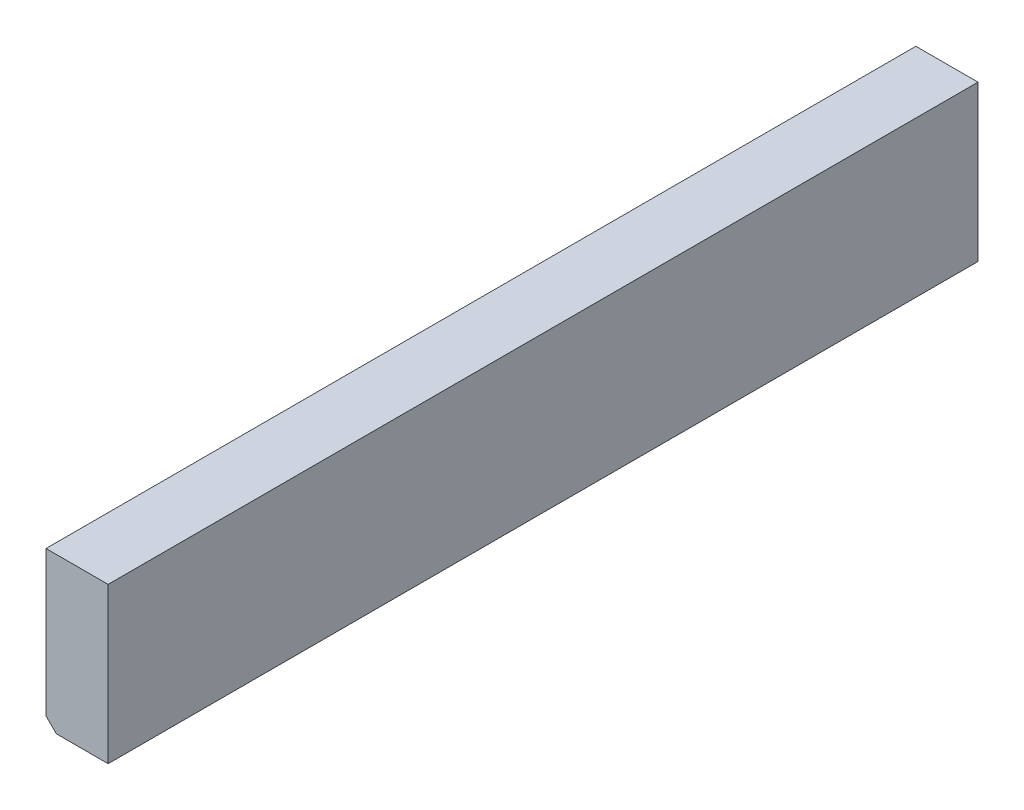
ISO-10303-21;
HEADER;
FILE_DESCRIPTION(('STEP AP214'),'2;1');
FILE_NAME('part.step','',(''),(''),'','','');
FILE_SCHEMA(('AUTOMOTIVE_DESIGN { 1 0 10303 214 1 1 1 1 }'));
ENDSEC;
DATA;
#1=APPLICATION_CONTEXT('core data for automotive mechanical design processes');
#2=APPLICATION_PROTOCOL_DEFINITION('international standard','automotive_design',2000,#1);
#3=PRODUCT_CONTEXT('',#1,'mechanical');
#4=PRODUCT('Part','Part','',(#3));
#5=PRODUCT_RELATED_PRODUCT_CATEGORY('part','',(#4));
#6=PRODUCT_DEFINITION_FORMATION('','',#4);
#7=PRODUCT_DEFINITION_CONTEXT('part definition',#1,'design');
#8=PRODUCT_DEFINITION('design','',#6,#7);
#9=PRODUCT_DEFINITION_SHAPE('','',#8);
#10=(LENGTH_UNIT() NAMED_UNIT(*) SI_UNIT(.MILLI.,.METRE.));
#11=(NAMED_UNIT(*) PLANE_ANGLE_UNIT() SI_UNIT($,.RADIAN.));
#12=(NAMED_UNIT(*) SI_UNIT($,.STERADIAN.) SOLID_ANGLE_UNIT());
#13=UNCERTAINTY_MEASURE_WITH_UNIT(LENGTH_MEASURE(1.E-05),#10,'distance_accuracy_value','');
#14=(GEOMETRIC_REPRESENTATION_CONTEXT(3) GLOBAL_UNCERTAINTY_ASSIGNED_CONTEXT((#13)) GLOBAL_UNIT_ASSIGNED_CONTEXT((#10,
#11,#12)) REPRESENTATION_CONTEXT('',''));
#15=CARTESIAN_POINT('',(0.,0.,0.));
#16=DIRECTION('',(0.,0.,1.));
#17=DIRECTION('',(1.,0.,0.));
#18=AXIS2_PLACEMENT_3D('',#15,#16,#17);
#19=CARTESIAN_POINT('',(0.,0.,-42.));
#20=DIRECTION('',(-1.,0.,0.));
#21=DIRECTION('',(0.,0.,1.));
#22=AXIS2_PLACEMENT_3D('',#19,#20,#21);
#23=PLANE('',#22);
#24=DIRECTION('',(0.,-1.,0.));
#25=VECTOR('',#24,1.);
#26=CARTESIAN_POINT('',(0.,0.,-42.));
#27=LINE('',#26,#25);
#28=CARTESIAN_POINT('',(0.,7.5,-42.));
#29=VERTEX_POINT('',#28);
#30=CARTESIAN_POINT('',(0.,0.5,-42.));
#31=VERTEX_POINT('',#30);
#32=EDGE_CURVE('E93',#29,#31,#27,.T.);
#33=ORIENTED_EDGE('',*,*,#32,.T.);
#34=DIRECTION('',(0.,0.,1.));
#35=VECTOR('',#34,1.);
#36=CARTESIAN_POINT('',(0.,0.5,-42.));
#37=LINE('',#36,#35);
#38=CARTESIAN_POINT('',(0.,0.5,0.));
#39=VERTEX_POINT('',#38);
#40=EDGE_CURVE('E106',#31,#39,#37,.T.);
#41=ORIENTED_EDGE('',*,*,#40,.T.);
#42=DIRECTION('',(0.,-1.,0.));
#43=VECTOR('',#42,1.);
#44=CARTESIAN_POINT('',(0.,0.,0.));
#45=LINE('',#44,#43);
#46=CARTESIAN_POINT('',(0.,7.5,0.));
#47=VERTEX_POINT('',#46);
#48=EDGE_CURVE('E78',#47,#39,#45,.T.);
#49=ORIENTED_EDGE('',*,*,#48,.F.);
#50=DIRECTION('',(0.,0.,1.));
#51=VECTOR('',#50,1.);
#52=CARTESIAN_POINT('',(0.,7.5,-42.));
#53=LINE('',#52,#51);
#54=EDGE_CURVE('E104',#29,#47,#53,.T.);
#55=ORIENTED_EDGE('',*,*,#54,.F.);
#56=EDGE_LOOP('',(#33,#41,#49,#55));
#57=FACE_BOUND('',#56,.T.);
#58=ADVANCED_FACE('F29',(#57),#23,.T.);
#59=CARTESIAN_POINT('',(0.,7.5,-42.));
#60=DIRECTION('',(0.,1.,0.));
#61=DIRECTION('',(0.,0.,1.));
#62=AXIS2_PLACEMENT_3D('',#59,#60,#61);
#63=PLANE('',#62);
#64=DIRECTION('',(-1.,0.,0.));
#65=VECTOR('',#64,1.);
#66=CARTESIAN_POINT('',(0.,7.5,0.));
#67=LINE('',#66,#65);
#68=CARTESIAN_POINT('',(3.,7.5,0.));
#69=VERTEX_POINT('',#68);
#70=EDGE_CURVE('E91',#69,#47,#67,.T.);
#71=ORIENTED_EDGE('',*,*,#70,.F.);
#72=DIRECTION('',(0.,0.,1.));
#73=VECTOR('',#72,1.);
#74=CARTESIAN_POINT('',(3.,7.5,-42.));
#75=LINE('',#74,#73);
#76=CARTESIAN_POINT('',(3.,7.5,-42.));
#77=VERTEX_POINT('',#76);
#78=EDGE_CURVE('E87',#77,#69,#75,.T.);
#79=ORIENTED_EDGE('',*,*,#78,.F.);
#80=DIRECTION('',(-1.,0.,0.));
#81=VECTOR('',#80,1.);
#82=CARTESIAN_POINT('',(0.,7.5,-42.));
#83=LINE('',#82,#81);
#84=EDGE_CURVE('E88',#77,#29,#83,.T.);
#85=ORIENTED_EDGE('',*,*,#84,.T.);
#86=ORIENTED_EDGE('',*,*,#54,.T.);
#87=EDGE_LOOP('',(#71,#79,#85,#86));
#88=FACE_BOUND('',#87,.T.);
#89=ADVANCED_FACE('F117',(#88),#63,.T.);
#90=CARTESIAN_POINT('',(3.,0.,-42.));
#91=DIRECTION('',(1.,0.,0.));
#92=DIRECTION('',(0.,1.,0.));
#93=AXIS2_PLACEMENT_3D('',#90,#91,#92);
#94=PLANE('',#93);
#95=DIRECTION('',(0.,1.,0.));
#96=VECTOR('',#95,1.);
#97=CARTESIAN_POINT('',(3.,0.,0.));
#98=LINE('',#97,#96);
#99=CARTESIAN_POINT('',(3.,0.,0.));
#100=VERTEX_POINT('',#99);
#101=EDGE_CURVE('E76',#100,#69,#98,.T.);
#102=ORIENTED_EDGE('',*,*,#101,.F.);
#103=DIRECTION('',(0.,0.,1.));
#104=VECTOR('',#103,1.);
#105=CARTESIAN_POINT('',(3.,0.,-42.));
#106=LINE('',#105,#104);
#107=CARTESIAN_POINT('',(3.,0.,-42.));
#108=VERTEX_POINT('',#107);
#109=EDGE_CURVE('E81',#108,#100,#106,.T.);
#110=ORIENTED_EDGE('',*,*,#109,.F.);
#111=DIRECTION('',(0.,1.,0.));
#112=VECTOR('',#111,1.);
#113=CARTESIAN_POINT('',(3.,0.,-42.));
#114=LINE('',#113,#112);
#115=EDGE_CURVE('E100',#108,#77,#114,.T.);
#116=ORIENTED_EDGE('',*,*,#115,.T.);
#117=ORIENTED_EDGE('',*,*,#78,.T.);
#118=EDGE_LOOP('',(#102,#110,#116,#117));
#119=FACE_BOUND('',#118,.T.);
#120=ADVANCED_FACE('F90',(#119),#94,.T.);
#121=CARTESIAN_POINT('',(0.,0.,-42.));
#122=DIRECTION('',(0.,-1.,0.));
#123=DIRECTION('',(0.,0.,-1.));
#124=AXIS2_PLACEMENT_3D('',#121,#122,#123);
#125=PLANE('',#124);
#126=DIRECTION('',(1.,0.,0.));
#127=VECTOR('',#126,1.);
#128=CARTESIAN_POINT('',(0.,0.,0.));
#129=LINE('',#128,#127);
#130=CARTESIAN_POINT('',(0.5,0.,0.));
#131=VERTEX_POINT('',#130);
#132=EDGE_CURVE('E71',#131,#100,#129,.T.);
#133=ORIENTED_EDGE('',*,*,#132,.F.);
#134=DIRECTION('',(0.,0.,-1.));
#135=VECTOR('',#134,1.);
#136=CARTESIAN_POINT('',(0.5,0.,-42.));
#137=LINE('',#136,#135);
#138=CARTESIAN_POINT('',(0.5,0.,-42.));
#139=VERTEX_POINT('',#138);
#140=EDGE_CURVE('E36',#131,#139,#137,.T.);
#141=ORIENTED_EDGE('',*,*,#140,.T.);
#142=DIRECTION('',(1.,0.,0.));
#143=VECTOR('',#142,1.);
#144=CARTESIAN_POINT('',(0.,0.,-42.));
#145=LINE('',#144,#143);
#146=EDGE_CURVE('E83',#139,#108,#145,.T.);
#147=ORIENTED_EDGE('',*,*,#146,.T.);
#148=ORIENTED_EDGE('',*,*,#109,.T.);
#149=EDGE_LOOP('',(#133,#141,#147,#148));
#150=FACE_BOUND('',#149,.T.);
#151=ADVANCED_FACE('F82',(#150),#125,.T.);
#152=CARTESIAN_POINT('',(0.,7.5,-42.));
#153=DIRECTION('',(0.,0.,-1.));
#154=DIRECTION('',(-1.,0.,0.));
#155=AXIS2_PLACEMENT_3D('',#152,#153,#154);
#156=PLANE('',#155);
#157=ORIENTED_EDGE('',*,*,#146,.F.);
#158=DIRECTION('',(0.707106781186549,-0.707106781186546,0.));
#159=VECTOR('',#158,1.);
#160=CARTESIAN_POINT('',(-3.5,3.99999999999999,-42.));
#161=LINE('',#160,#159);
#162=EDGE_CURVE('E11',#139,#31,#161,.F.);
#163=ORIENTED_EDGE('',*,*,#162,.T.);
#164=ORIENTED_EDGE('',*,*,#32,.F.);
#165=ORIENTED_EDGE('',*,*,#84,.F.);
#166=ORIENTED_EDGE('',*,*,#115,.F.);
#167=EDGE_LOOP('',(#157,#163,#164,#165,#166));
#168=FACE_BOUND('',#167,.T.);
#169=ADVANCED_FACE('F120',(#168),#156,.T.);
#170=CARTESIAN_POINT('',(0.,7.5,0.));
#171=DIRECTION('',(0.,0.,-1.));
#172=DIRECTION('',(-1.,0.,0.));
#173=AXIS2_PLACEMENT_3D('',#170,#171,#172);
#174=PLANE('',#173);
#175=ORIENTED_EDGE('',*,*,#48,.T.);
#176=DIRECTION('',(-0.707106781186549,0.707106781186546,0.));
#177=VECTOR('',#176,1.);
#178=CARTESIAN_POINT('',(0.,0.5,0.));
#179=LINE('',#178,#177);
#180=EDGE_CURVE('E50',#39,#131,#179,.F.);
#181=ORIENTED_EDGE('',*,*,#180,.T.);
#182=ORIENTED_EDGE('',*,*,#132,.T.);
#183=ORIENTED_EDGE('',*,*,#101,.T.);
#184=ORIENTED_EDGE('',*,*,#70,.T.);
#185=EDGE_LOOP('',(#175,#181,#182,#183,#184));
#186=FACE_BOUND('',#185,.T.);
#187=ADVANCED_FACE('F73',(#186),#174,.F.);
#188=CARTESIAN_POINT('',(0.,0.5,-42.));
#189=DIRECTION('',(0.707106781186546,0.707106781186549,0.));
#190=DIRECTION('',(-0.707106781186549,0.707106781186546,0.));
#191=AXIS2_PLACEMENT_3D('',#188,#189,#190);
#192=PLANE('',#191);
#193=ORIENTED_EDGE('',*,*,#162,.F.);
#194=ORIENTED_EDGE('',*,*,#140,.F.);
#195=ORIENTED_EDGE('',*,*,#180,.F.);
#196=ORIENTED_EDGE('',*,*,#40,.F.);
#197=EDGE_LOOP('',(#193,#194,#195,#196));
#198=FACE_BOUND('',#197,.T.);
#199=ADVANCED_FACE('F121',(#198),#192,.F.);
#200=CLOSED_SHELL('',(#58,#89,#120,#151,#169,#187,#199));
#201=MANIFOLD_SOLID_BREP('B2',#200);
#202=ADVANCED_BREP_SHAPE_REPRESENTATION('',(#18,#201),#14);
#203=SHAPE_DEFINITION_REPRESENTATION(#9,#202);
ENDSEC;
END-ISO-10303-21;
